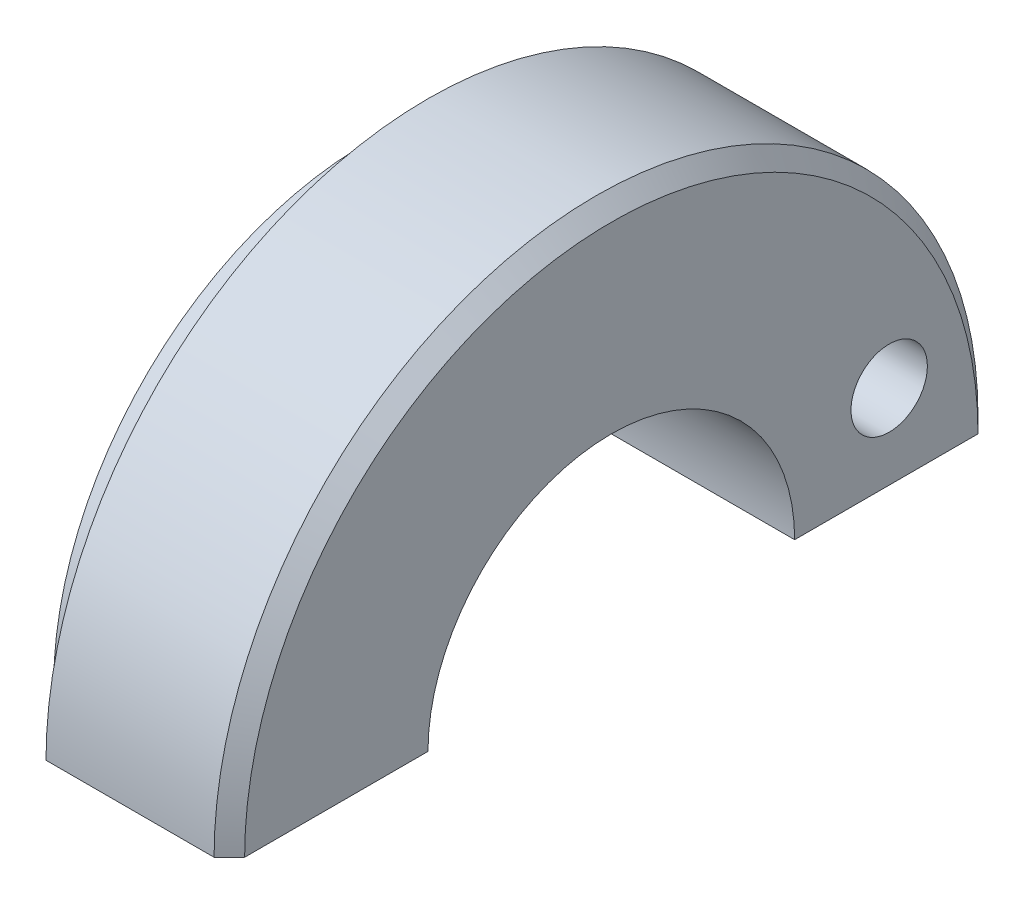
from build123d import *

# Parameters (mm, degrees)
BASE_R_VOLUTION_ANGLE = 180
PER_AGE1_D            = 2.5
PER_AGE1_DEPTH        = 4.5
PER_AGE1_TIP          = 0.751075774


with BuildPart() as part:
    # Esquisse1 → Base-R_volution (revolve)
    with BuildSketch(Plane.XZ.offset(0.1008389)):
        Polygon((-6.362816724, 10.25), (-6.862816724, 10.25), (-6.862816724, 6), (1.137183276, 6), (1.137183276, 12), (0.637183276, 12.5), (-4.862816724, 12.5), (-4.862816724, 9), (-6.362816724, 9), align=None)
    revolve(axis=Axis((-6.862816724, -0.1008389, 0), (-1, 0, 0)), revolution_arc=BASE_R_VOLUTION_ANGLE)

    # Per_age1
    with Locations(Plane(origin=(1.137183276, 0, 0), x_dir=(0, 0, -1), z_dir=(1, 0, 0))):
        with Locations((9.09326674, 2.6491611)):
            Hole(PER_AGE1_D / 2, depth=PER_AGE1_DEPTH)
            with Locations((0, 0, -(PER_AGE1_DEPTH + PER_AGE1_TIP / 2))):  # 118° drill point
                Cone(0, PER_AGE1_D / 2, PER_AGE1_TIP, mode=Mode.SUBTRACT)


solid = part.part
